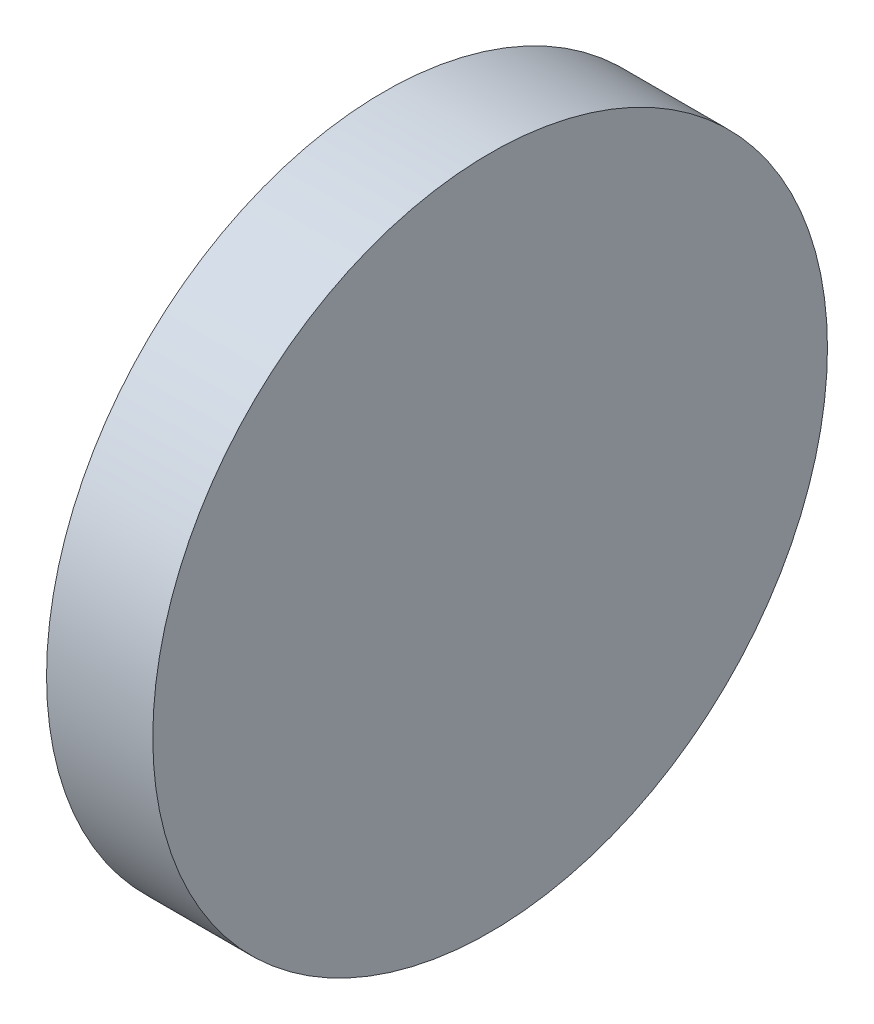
from build123d import *

# Parameters (mm, degrees)
SKETCH1_R           = 31.75
BOSS_EXTRUDE1_DEPTH = 5


with BuildPart() as part:
    # Sketch1 → Boss-Extrude1 (new, symmetric)
    with BuildSketch(Plane(origin=(0, 0, 0), x_dir=(0, 0, -1), z_dir=(1, 0, 0))):
        Circle(SKETCH1_R)
    extrude(amount=BOSS_EXTRUDE1_DEPTH, both=True)


solid = part.part
